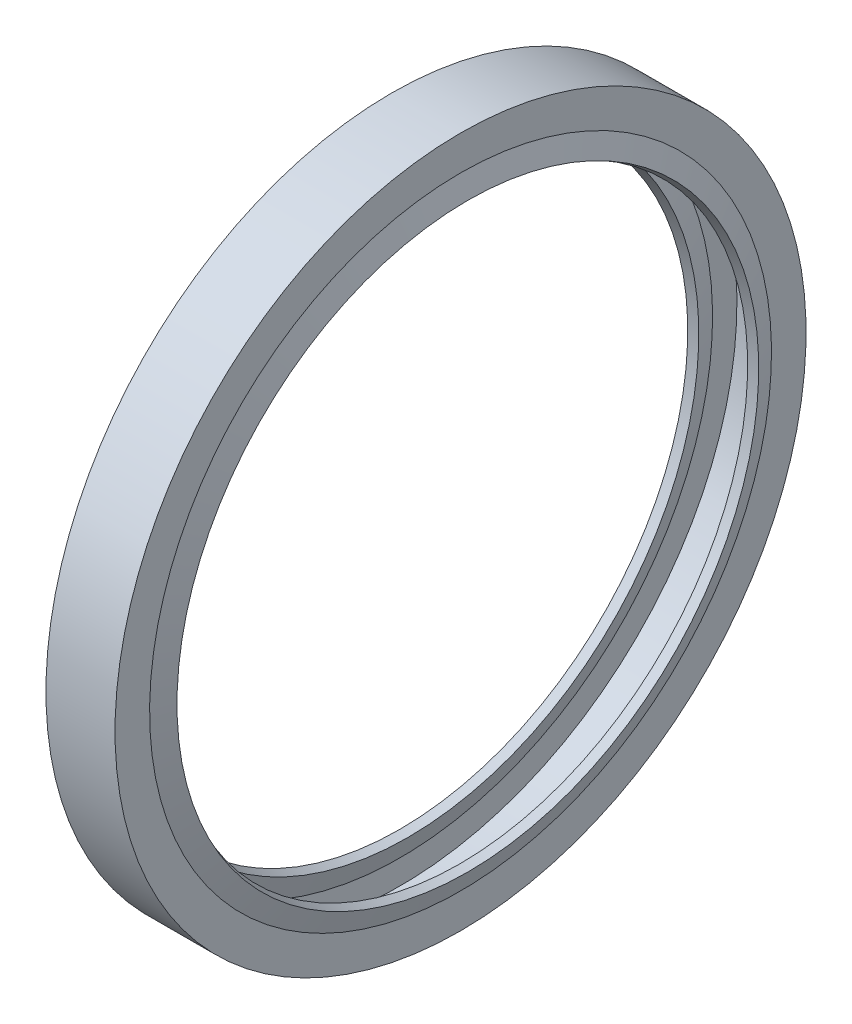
ISO-10303-21;
HEADER;
FILE_DESCRIPTION(('STEP AP214'),'2;1');
FILE_NAME('part.step','',(''),(''),'','','');
FILE_SCHEMA(('AUTOMOTIVE_DESIGN { 1 0 10303 214 1 1 1 1 }'));
ENDSEC;
DATA;
#1=APPLICATION_CONTEXT('core data for automotive mechanical design processes');
#2=APPLICATION_PROTOCOL_DEFINITION('international standard','automotive_design',2000,#1);
#3=PRODUCT_CONTEXT('',#1,'mechanical');
#4=PRODUCT('Part','Part','',(#3));
#5=PRODUCT_RELATED_PRODUCT_CATEGORY('part','',(#4));
#6=PRODUCT_DEFINITION_FORMATION('','',#4);
#7=PRODUCT_DEFINITION_CONTEXT('part definition',#1,'design');
#8=PRODUCT_DEFINITION('design','',#6,#7);
#9=PRODUCT_DEFINITION_SHAPE('','',#8);
#10=(LENGTH_UNIT() NAMED_UNIT(*) SI_UNIT(.MILLI.,.METRE.));
#11=(NAMED_UNIT(*) PLANE_ANGLE_UNIT() SI_UNIT($,.RADIAN.));
#12=(NAMED_UNIT(*) SI_UNIT($,.STERADIAN.) SOLID_ANGLE_UNIT());
#13=UNCERTAINTY_MEASURE_WITH_UNIT(LENGTH_MEASURE(1.E-05),#10,'distance_accuracy_value','');
#14=(GEOMETRIC_REPRESENTATION_CONTEXT(3) GLOBAL_UNCERTAINTY_ASSIGNED_CONTEXT((#13)) GLOBAL_UNIT_ASSIGNED_CONTEXT((#10,
#11,#12)) REPRESENTATION_CONTEXT('',''));
#15=CARTESIAN_POINT('',(0.,0.,0.));
#16=DIRECTION('',(0.,0.,1.));
#17=DIRECTION('',(1.,0.,0.));
#18=AXIS2_PLACEMENT_3D('',#15,#16,#17);
#19=CARTESIAN_POINT('',(0.,0.,0.));
#20=DIRECTION('',(1.,0.,0.));
#21=DIRECTION('',(0.,1.,0.));
#22=AXIS2_PLACEMENT_3D('',#19,#20,#21);
#23=CYLINDRICAL_SURFACE('',#22,60.);
#24=CARTESIAN_POINT('',(-20.8245782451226,0.,0.));
#25=DIRECTION('',(1.,0.,0.));
#26=DIRECTION('',(0.,1.,0.));
#27=AXIS2_PLACEMENT_3D('',#24,#25,#26);
#28=CIRCLE('',#27,60.);
#29=CARTESIAN_POINT('',(-20.8245782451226,60.,0.));
#30=VERTEX_POINT('',#29);
#31=EDGE_CURVE('E70',#30,#30,#28,.T.);
#32=ORIENTED_EDGE('',*,*,#31,.T.);
#33=EDGE_LOOP('',(#32));
#34=FACE_BOUND('',#33,.T.);
#35=CARTESIAN_POINT('',(-8.82457824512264,0.,0.));
#36=DIRECTION('',(1.,0.,0.));
#37=DIRECTION('',(0.,1.,0.));
#38=AXIS2_PLACEMENT_3D('',#35,#36,#37);
#39=CIRCLE('',#38,60.);
#40=CARTESIAN_POINT('',(-8.82457824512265,60.,0.));
#41=VERTEX_POINT('',#40);
#42=EDGE_CURVE('E10',#41,#41,#39,.T.);
#43=ORIENTED_EDGE('',*,*,#42,.F.);
#44=EDGE_LOOP('',(#43));
#45=FACE_BOUND('',#44,.T.);
#46=ADVANCED_FACE('F30',(#34,#45),#23,.T.);
#47=CARTESIAN_POINT('',(-8.82457824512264,60.,0.));
#48=DIRECTION('',(1.,0.,0.));
#49=DIRECTION('',(0.,1.,0.));
#50=AXIS2_PLACEMENT_3D('',#47,#48,#49);
#51=PLANE('',#50);
#52=ORIENTED_EDGE('',*,*,#42,.T.);
#53=EDGE_LOOP('',(#52));
#54=FACE_BOUND('',#53,.T.);
#55=CARTESIAN_POINT('',(-8.82457824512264,0.,0.));
#56=DIRECTION('',(1.,0.,0.));
#57=DIRECTION('',(0.,1.,0.));
#58=AXIS2_PLACEMENT_3D('',#55,#56,#57);
#59=CIRCLE('',#58,54.);
#60=CARTESIAN_POINT('',(-8.82457824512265,54.,0.));
#61=VERTEX_POINT('',#60);
#62=EDGE_CURVE('E36',#61,#61,#59,.T.);
#63=ORIENTED_EDGE('',*,*,#62,.F.);
#64=EDGE_LOOP('',(#63));
#65=FACE_BOUND('',#64,.T.);
#66=ADVANCED_FACE('F88',(#54,#65),#51,.T.);
#67=CARTESIAN_POINT('',(-7.55542503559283,0.,0.));
#68=DIRECTION('',(-1.,0.,0.));
#69=DIRECTION('',(0.,-1.,0.));
#70=AXIS2_PLACEMENT_3D('',#67,#68,#69);
#71=CONICAL_SURFACE('',#70,50.5130302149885,1.22173047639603);
#72=ORIENTED_EDGE('',*,*,#62,.T.);
#73=EDGE_LOOP('',(#72));
#74=FACE_BOUND('',#73,.T.);
#75=CARTESIAN_POINT('',(-7.55542503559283,0.,0.));
#76=DIRECTION('',(1.,0.,0.));
#77=DIRECTION('',(0.,1.,0.));
#78=AXIS2_PLACEMENT_3D('',#75,#76,#77);
#79=CIRCLE('',#78,50.5130302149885);
#80=CARTESIAN_POINT('',(-7.55542503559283,50.5130302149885,0.));
#81=VERTEX_POINT('',#80);
#82=EDGE_CURVE('E40',#81,#81,#79,.T.);
#83=ORIENTED_EDGE('',*,*,#82,.F.);
#84=EDGE_LOOP('',(#83));
#85=FACE_BOUND('',#84,.T.);
#86=ADVANCED_FACE('F92',(#74,#85),#71,.T.);
#87=CARTESIAN_POINT('',(-8.9649639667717,0.,0.));
#88=DIRECTION('',(1.,0.,0.));
#89=DIRECTION('',(0.,1.,0.));
#90=AXIS2_PLACEMENT_3D('',#87,#88,#89);
#91=CONICAL_SURFACE('',#90,50.,0.349065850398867);
#92=ORIENTED_EDGE('',*,*,#82,.T.);
#93=EDGE_LOOP('',(#92));
#94=FACE_BOUND('',#93,.T.);
#95=CARTESIAN_POINT('',(-8.9649639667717,0.,0.));
#96=DIRECTION('',(1.,0.,0.));
#97=DIRECTION('',(0.,1.,0.));
#98=AXIS2_PLACEMENT_3D('',#95,#96,#97);
#99=CIRCLE('',#98,50.);
#100=CARTESIAN_POINT('',(-8.9649639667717,50.,0.));
#101=VERTEX_POINT('',#100);
#102=EDGE_CURVE('E44',#101,#101,#99,.T.);
#103=ORIENTED_EDGE('',*,*,#102,.F.);
#104=EDGE_LOOP('',(#103));
#105=FACE_BOUND('',#104,.T.);
#106=ADVANCED_FACE('F96',(#94,#105),#91,.F.);
#107=CARTESIAN_POINT('',(-10.3245782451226,0.,0.));
#108=DIRECTION('',(-1.,0.,0.));
#109=DIRECTION('',(0.,-1.,0.));
#110=AXIS2_PLACEMENT_3D('',#107,#108,#109);
#111=CONICAL_SURFACE('',#110,53.7355095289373,1.22173047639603);
#112=ORIENTED_EDGE('',*,*,#102,.T.);
#113=EDGE_LOOP('',(#112));
#114=FACE_BOUND('',#113,.T.);
#115=CARTESIAN_POINT('',(-10.3245782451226,0.,0.));
#116=DIRECTION('',(1.,0.,0.));
#117=DIRECTION('',(0.,1.,0.));
#118=AXIS2_PLACEMENT_3D('',#115,#116,#117);
#119=CIRCLE('',#118,53.7355095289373);
#120=CARTESIAN_POINT('',(-10.3245782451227,53.7355095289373,0.));
#121=VERTEX_POINT('',#120);
#122=EDGE_CURVE('E49',#121,#121,#119,.T.);
#123=ORIENTED_EDGE('',*,*,#122,.F.);
#124=EDGE_LOOP('',(#123));
#125=FACE_BOUND('',#124,.T.);
#126=ADVANCED_FACE('F102',(#114,#125),#111,.F.);
#127=CARTESIAN_POINT('',(-10.3245782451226,58.5,0.));
#128=DIRECTION('',(-1.,0.,0.));
#129=DIRECTION('',(0.,-1.,0.));
#130=AXIS2_PLACEMENT_3D('',#127,#128,#129);
#131=PLANE('',#130);
#132=ORIENTED_EDGE('',*,*,#122,.T.);
#133=EDGE_LOOP('',(#132));
#134=FACE_BOUND('',#133,.T.);
#135=CARTESIAN_POINT('',(-10.3245782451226,0.,0.));
#136=DIRECTION('',(1.,0.,0.));
#137=DIRECTION('',(0.,1.,0.));
#138=AXIS2_PLACEMENT_3D('',#135,#136,#137);
#139=CIRCLE('',#138,58.5);
#140=CARTESIAN_POINT('',(-10.3245782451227,58.5,0.));
#141=VERTEX_POINT('',#140);
#142=EDGE_CURVE('E52',#141,#141,#139,.T.);
#143=ORIENTED_EDGE('',*,*,#142,.F.);
#144=EDGE_LOOP('',(#143));
#145=FACE_BOUND('',#144,.T.);
#146=ADVANCED_FACE('F106',(#134,#145),#131,.T.);
#147=CARTESIAN_POINT('',(0.,0.,0.));
#148=DIRECTION('',(1.,0.,0.));
#149=DIRECTION('',(0.,1.,0.));
#150=AXIS2_PLACEMENT_3D('',#147,#148,#149);
#151=CYLINDRICAL_SURFACE('',#150,58.5);
#152=ORIENTED_EDGE('',*,*,#142,.T.);
#153=EDGE_LOOP('',(#152));
#154=FACE_BOUND('',#153,.T.);
#155=CARTESIAN_POINT('',(-19.3245782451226,0.,0.));
#156=DIRECTION('',(1.,0.,0.));
#157=DIRECTION('',(0.,1.,0.));
#158=AXIS2_PLACEMENT_3D('',#155,#156,#157);
#159=CIRCLE('',#158,58.5);
#160=CARTESIAN_POINT('',(-19.3245782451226,58.5,0.));
#161=VERTEX_POINT('',#160);
#162=EDGE_CURVE('E55',#161,#161,#159,.T.);
#163=ORIENTED_EDGE('',*,*,#162,.F.);
#164=EDGE_LOOP('',(#163));
#165=FACE_BOUND('',#164,.T.);
#166=ADVANCED_FACE('F110',(#154,#165),#151,.F.);
#167=CARTESIAN_POINT('',(-19.3245782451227,54.2644904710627,0.));
#168=DIRECTION('',(1.,0.,0.));
#169=DIRECTION('',(0.,1.,0.));
#170=AXIS2_PLACEMENT_3D('',#167,#168,#169);
#171=PLANE('',#170);
#172=ORIENTED_EDGE('',*,*,#162,.T.);
#173=EDGE_LOOP('',(#172));
#174=FACE_BOUND('',#173,.T.);
#175=CARTESIAN_POINT('',(-19.3245782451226,0.,0.));
#176=DIRECTION('',(1.,0.,0.));
#177=DIRECTION('',(0.,1.,0.));
#178=AXIS2_PLACEMENT_3D('',#175,#176,#177);
#179=CIRCLE('',#178,54.2644904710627);
#180=CARTESIAN_POINT('',(-19.3245782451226,54.2644904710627,0.));
#181=VERTEX_POINT('',#180);
#182=EDGE_CURVE('E58',#181,#181,#179,.T.);
#183=ORIENTED_EDGE('',*,*,#182,.F.);
#184=EDGE_LOOP('',(#183));
#185=FACE_BOUND('',#184,.T.);
#186=ADVANCED_FACE('F114',(#174,#185),#171,.T.);
#187=CARTESIAN_POINT('',(-17.959158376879,0.,0.));
#188=DIRECTION('',(-1.,0.,0.));
#189=DIRECTION('',(0.,-1.,0.));
#190=AXIS2_PLACEMENT_3D('',#187,#188,#189);
#191=CONICAL_SURFACE('',#190,50.5130302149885,1.22173047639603);
#192=ORIENTED_EDGE('',*,*,#182,.T.);
#193=EDGE_LOOP('',(#192));
#194=FACE_BOUND('',#193,.T.);
#195=CARTESIAN_POINT('',(-17.959158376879,0.,0.));
#196=DIRECTION('',(1.,0.,0.));
#197=DIRECTION('',(0.,1.,0.));
#198=AXIS2_PLACEMENT_3D('',#195,#196,#197);
#199=CIRCLE('',#198,50.5130302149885);
#200=CARTESIAN_POINT('',(-17.959158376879,50.5130302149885,0.));
#201=VERTEX_POINT('',#200);
#202=EDGE_CURVE('E61',#201,#201,#199,.T.);
#203=ORIENTED_EDGE('',*,*,#202,.F.);
#204=EDGE_LOOP('',(#203));
#205=FACE_BOUND('',#204,.T.);
#206=ADVANCED_FACE('F118',(#194,#205),#191,.T.);
#207=CARTESIAN_POINT('',(-19.3686973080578,0.,0.));
#208=DIRECTION('',(1.,0.,0.));
#209=DIRECTION('',(0.,1.,0.));
#210=AXIS2_PLACEMENT_3D('',#207,#208,#209);
#211=CONICAL_SURFACE('',#210,50.,0.349065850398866);
#212=ORIENTED_EDGE('',*,*,#202,.T.);
#213=EDGE_LOOP('',(#212));
#214=FACE_BOUND('',#213,.T.);
#215=CARTESIAN_POINT('',(-19.3686973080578,0.,0.));
#216=DIRECTION('',(1.,0.,0.));
#217=DIRECTION('',(0.,1.,0.));
#218=AXIS2_PLACEMENT_3D('',#215,#216,#217);
#219=CIRCLE('',#218,50.);
#220=CARTESIAN_POINT('',(-19.3686973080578,50.,0.));
#221=VERTEX_POINT('',#220);
#222=EDGE_CURVE('E64',#221,#221,#219,.T.);
#223=ORIENTED_EDGE('',*,*,#222,.F.);
#224=EDGE_LOOP('',(#223));
#225=FACE_BOUND('',#224,.T.);
#226=ADVANCED_FACE('F84',(#214,#225),#211,.F.);
#227=CARTESIAN_POINT('',(-20.8245782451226,0.,0.));
#228=DIRECTION('',(-1.,0.,0.));
#229=DIRECTION('',(0.,-1.,0.));
#230=AXIS2_PLACEMENT_3D('',#227,#228,#229);
#231=CONICAL_SURFACE('',#230,54.,1.22173047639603);
#232=ORIENTED_EDGE('',*,*,#222,.T.);
#233=EDGE_LOOP('',(#232));
#234=FACE_BOUND('',#233,.T.);
#235=CARTESIAN_POINT('',(-20.8245782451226,0.,0.));
#236=DIRECTION('',(1.,0.,0.));
#237=DIRECTION('',(0.,1.,0.));
#238=AXIS2_PLACEMENT_3D('',#235,#236,#237);
#239=CIRCLE('',#238,54.);
#240=CARTESIAN_POINT('',(-20.8245782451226,54.,0.));
#241=VERTEX_POINT('',#240);
#242=EDGE_CURVE('E67',#241,#241,#239,.T.);
#243=ORIENTED_EDGE('',*,*,#242,.F.);
#244=EDGE_LOOP('',(#243));
#245=FACE_BOUND('',#244,.T.);
#246=ADVANCED_FACE('F78',(#234,#245),#231,.F.);
#247=CARTESIAN_POINT('',(-20.8245782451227,60.,0.));
#248=DIRECTION('',(-1.,0.,0.));
#249=DIRECTION('',(0.,-1.,0.));
#250=AXIS2_PLACEMENT_3D('',#247,#248,#249);
#251=PLANE('',#250);
#252=ORIENTED_EDGE('',*,*,#242,.T.);
#253=EDGE_LOOP('',(#252));
#254=FACE_BOUND('',#253,.T.);
#255=ORIENTED_EDGE('',*,*,#31,.F.);
#256=EDGE_LOOP('',(#255));
#257=FACE_BOUND('',#256,.T.);
#258=ADVANCED_FACE('F76',(#254,#257),#251,.T.);
#259=CLOSED_SHELL('',(#46,#66,#86,#106,#126,#146,#166,#186,#206,#226,#246,#258));
#260=MANIFOLD_SOLID_BREP('B2',#259);
#261=ADVANCED_BREP_SHAPE_REPRESENTATION('',(#18,#260),#14);
#262=SHAPE_DEFINITION_REPRESENTATION(#9,#261);
ENDSEC;
END-ISO-10303-21;
